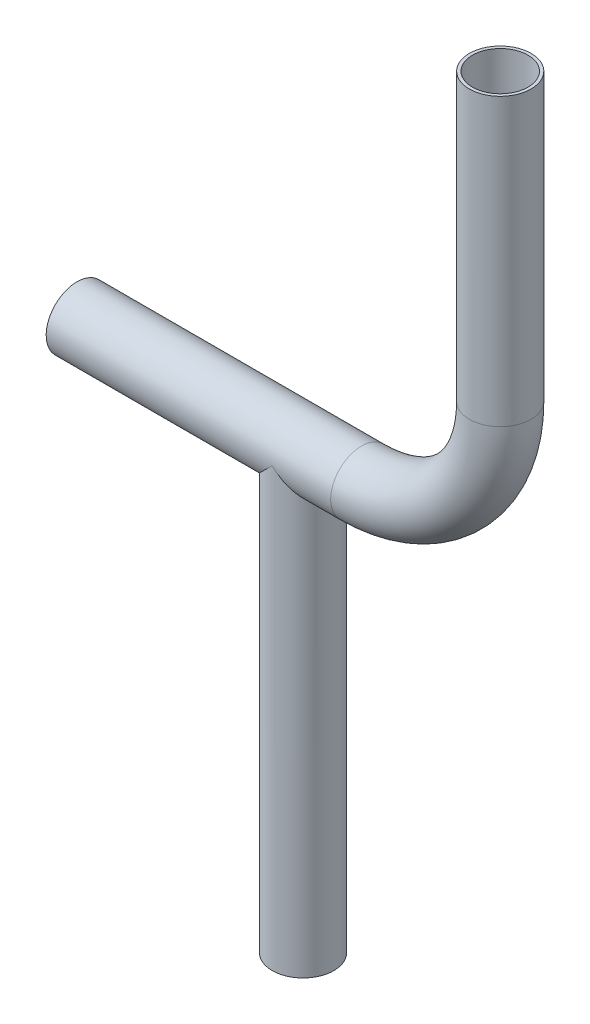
from build123d import *

# Parameters (mm, degrees)
ESQUISSE3_R             = 30
ESQUISSE3_R_2           = 27
BOSS_EXTRU_1_REACH      = 869.893
BOSS_EXTRU_1_END_RADIUS = 30
ESQUISSE4_R             = 30
ESQUISSE4_R_2           = 27


with BuildPart() as part:
    # Balayage1: sweep along a path in Esquisse2
    with BuildLine(Plane.XY) as balayage1_path:
        Line((-219.813416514, 425.366292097), (56.880472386, 425.366292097))
        ThreePointArc((56.880472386, 425.366292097), (152.273364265, 464.879321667), (191.786393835, 560.272213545))
        Line((191.786393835, 560.272213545), (191.786393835, 838.539438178))
    # Esquisse3 → Balayage1 (sweep)
    with BuildSketch(Plane(origin=(-219.813416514, 0, 0), x_dir=(0, 0, -1), z_dir=(1, 0, 0))):
        with Locations((0, 425.366292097)):
            Circle(ESQUISSE3_R)
        with Locations((0, 425.366292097)):
            Circle(ESQUISSE3_R_2, mode=Mode.SUBTRACT)
    sweep(path=balayage1_path.line)

    # Boss.-Extru.1: up to this cylinder (the profile starts outside it)
    boss_extru_1_end = Plane(origin=(0, 425.366292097, 0), z_dir=(-1, 0, 0)) * Cylinder(BOSS_EXTRU_1_END_RADIUS, 1800.786, mode=Mode.PRIVATE)
    # Esquisse4 → Boss.-Extru.1 (add, up to the surface)
    with BuildSketch(Plane(origin=(0, 0, 0), x_dir=(1, 0, 0), z_dir=(0, 1, 0)), mode=Mode.PRIVATE) as boss_extru_1_sk1:
        with Locations(Location((0, 0, 0), (0, 0, 270))):
            Circle(ESQUISSE4_R)
        with Locations(Location((0, 0, 0), (0, 0, 90))):
            Circle(ESQUISSE4_R_2, mode=Mode.SUBTRACT)
    boss_extru_1_tool1 = extrude(boss_extru_1_sk1.sketch, amount=BOSS_EXTRU_1_REACH, mode=Mode.PRIVATE) - boss_extru_1_end
    add(boss_extru_1_tool1.solids().sort_by_distance((0, 0, -29.151472))[0])


solid = part.part
